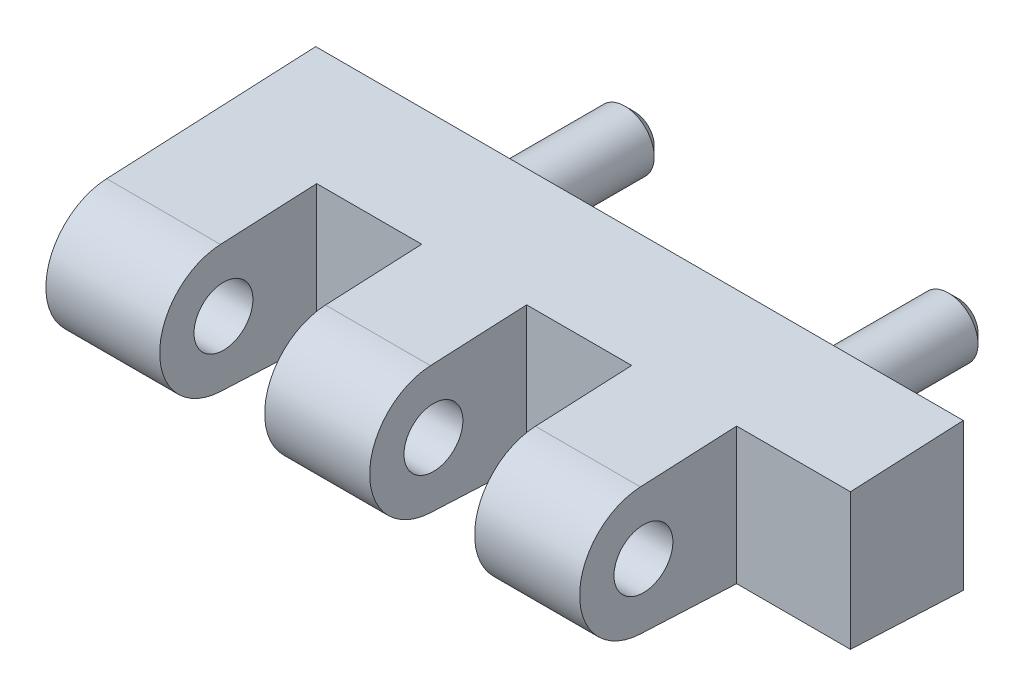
ISO-10303-21;
HEADER;
FILE_DESCRIPTION(('STEP AP214'),'2;1');
FILE_NAME('part.step','',(''),(''),'','','');
FILE_SCHEMA(('AUTOMOTIVE_DESIGN { 1 0 10303 214 1 1 1 1 }'));
ENDSEC;
DATA;
#1=APPLICATION_CONTEXT('core data for automotive mechanical design processes');
#2=APPLICATION_PROTOCOL_DEFINITION('international standard','automotive_design',2000,#1);
#3=PRODUCT_CONTEXT('',#1,'mechanical');
#4=PRODUCT('Part','Part','',(#3));
#5=PRODUCT_RELATED_PRODUCT_CATEGORY('part','',(#4));
#6=PRODUCT_DEFINITION_FORMATION('','',#4);
#7=PRODUCT_DEFINITION_CONTEXT('part definition',#1,'design');
#8=PRODUCT_DEFINITION('design','',#6,#7);
#9=PRODUCT_DEFINITION_SHAPE('','',#8);
#10=(LENGTH_UNIT() NAMED_UNIT(*) SI_UNIT(.MILLI.,.METRE.));
#11=(NAMED_UNIT(*) PLANE_ANGLE_UNIT() SI_UNIT($,.RADIAN.));
#12=(NAMED_UNIT(*) SI_UNIT($,.STERADIAN.) SOLID_ANGLE_UNIT());
#13=UNCERTAINTY_MEASURE_WITH_UNIT(LENGTH_MEASURE(1.E-05),#10,'distance_accuracy_value','');
#14=(GEOMETRIC_REPRESENTATION_CONTEXT(3) GLOBAL_UNCERTAINTY_ASSIGNED_CONTEXT((#13)) GLOBAL_UNIT_ASSIGNED_CONTEXT((#10,
#11,#12)) REPRESENTATION_CONTEXT('',''));
#15=CARTESIAN_POINT('',(0.,0.,0.));
#16=DIRECTION('',(0.,0.,1.));
#17=DIRECTION('',(1.,0.,0.));
#18=AXIS2_PLACEMENT_3D('',#15,#16,#17);
#19=CARTESIAN_POINT('',(49.5,0.,21.));
#20=DIRECTION('',(-1.,0.,0.));
#21=DIRECTION('',(0.,0.,1.));
#22=AXIS2_PLACEMENT_3D('',#19,#20,#21);
#23=CYLINDRICAL_SURFACE('',#22,6.5);
#24=DIRECTION('',(-1.,0.,0.));
#25=VECTOR('',#24,1.);
#26=CARTESIAN_POINT('',(49.5,-6.49274913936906,21.3069342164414));
#27=LINE('',#26,#25);
#28=CARTESIAN_POINT('',(-4.9,-6.49274913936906,21.3069342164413));
#29=VERTEX_POINT('',#28);
#30=CARTESIAN_POINT('',(-16.5,-6.49274913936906,21.3069342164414));
#31=VERTEX_POINT('',#30);
#32=EDGE_CURVE('E224',#29,#31,#27,.T.);
#33=ORIENTED_EDGE('',*,*,#32,.F.);
#34=CARTESIAN_POINT('',(-4.9,0.,21.));
#35=DIRECTION('',(-1.,0.,0.));
#36=DIRECTION('',(0.,0.,1.));
#37=AXIS2_PLACEMENT_3D('',#34,#35,#36);
#38=CIRCLE('',#37,6.5);
#39=CARTESIAN_POINT('',(-4.9,6.49274913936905,21.3069342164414));
#40=VERTEX_POINT('',#39);
#41=EDGE_CURVE('E181',#29,#40,#38,.T.);
#42=ORIENTED_EDGE('',*,*,#41,.T.);
#43=DIRECTION('',(-1.,0.,0.));
#44=VECTOR('',#43,1.);
#45=CARTESIAN_POINT('',(49.5,6.49274913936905,21.3069342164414));
#46=LINE('',#45,#44);
#47=CARTESIAN_POINT('',(-16.5,6.49274913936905,21.3069342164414));
#48=VERTEX_POINT('',#47);
#49=EDGE_CURVE('E228',#40,#48,#46,.T.);
#50=ORIENTED_EDGE('',*,*,#49,.T.);
#51=CARTESIAN_POINT('',(-16.5,0.,21.));
#52=DIRECTION('',(1.,0.,0.));
#53=DIRECTION('',(0.,0.,-1.));
#54=AXIS2_PLACEMENT_3D('',#51,#52,#53);
#55=CIRCLE('',#54,6.5);
#56=EDGE_CURVE('E213',#48,#31,#55,.T.);
#57=ORIENTED_EDGE('',*,*,#56,.T.);
#58=EDGE_LOOP('',(#33,#42,#50,#57));
#59=FACE_BOUND('',#58,.T.);
#60=ADVANCED_FACE('F14',(#59),#23,.T.);
#61=CARTESIAN_POINT('',(16.5,6.49274913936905,21.3069342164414));
#62=VERTEX_POINT('',#61);
#63=CARTESIAN_POINT('',(5.8,6.49274913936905,21.3069342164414));
#64=VERTEX_POINT('',#63);
#65=EDGE_CURVE('E230',#62,#64,#46,.T.);
#66=ORIENTED_EDGE('',*,*,#65,.T.);
#67=CARTESIAN_POINT('',(5.8,0.,21.));
#68=DIRECTION('',(1.,0.,0.));
#69=DIRECTION('',(0.,0.,-1.));
#70=AXIS2_PLACEMENT_3D('',#67,#68,#69);
#71=CIRCLE('',#70,6.5);
#72=CARTESIAN_POINT('',(5.8,-6.49274913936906,21.3069342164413));
#73=VERTEX_POINT('',#72);
#74=EDGE_CURVE('E171',#64,#73,#71,.T.);
#75=ORIENTED_EDGE('',*,*,#74,.T.);
#76=CARTESIAN_POINT('',(16.5,-6.49274913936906,21.3069342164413));
#77=VERTEX_POINT('',#76);
#78=EDGE_CURVE('E226',#77,#73,#27,.T.);
#79=ORIENTED_EDGE('',*,*,#78,.F.);
#80=CARTESIAN_POINT('',(16.5,0.,21.));
#81=DIRECTION('',(-1.,0.,0.));
#82=DIRECTION('',(0.,0.,1.));
#83=AXIS2_PLACEMENT_3D('',#80,#81,#82);
#84=CIRCLE('',#83,6.5);
#85=EDGE_CURVE('E161',#77,#62,#84,.T.);
#86=ORIENTED_EDGE('',*,*,#85,.T.);
#87=EDGE_LOOP('',(#66,#75,#79,#86));
#88=FACE_BOUND('',#87,.T.);
#89=ADVANCED_FACE('F271',(#88),#23,.T.);
#90=CARTESIAN_POINT('',(49.5,0.,21.));
#91=DIRECTION('',(-1.,0.,0.));
#92=DIRECTION('',(0.,0.,1.));
#93=AXIS2_PLACEMENT_3D('',#90,#91,#92);
#94=CYLINDRICAL_SURFACE('',#93,3.);
#95=CARTESIAN_POINT('',(-4.9,0.,21.));
#96=DIRECTION('',(-1.,0.,0.));
#97=DIRECTION('',(0.,0.,1.));
#98=AXIS2_PLACEMENT_3D('',#95,#96,#97);
#99=CIRCLE('',#98,3.);
#100=CARTESIAN_POINT('',(-4.9,0.,24.));
#101=VERTEX_POINT('',#100);
#102=EDGE_CURVE('E177',#101,#101,#99,.T.);
#103=ORIENTED_EDGE('',*,*,#102,.F.);
#104=EDGE_LOOP('',(#103));
#105=FACE_BOUND('',#104,.T.);
#106=CARTESIAN_POINT('',(-16.5,0.,21.));
#107=DIRECTION('',(1.,0.,0.));
#108=DIRECTION('',(0.,0.,-1.));
#109=AXIS2_PLACEMENT_3D('',#106,#107,#108);
#110=CIRCLE('',#109,3.);
#111=CARTESIAN_POINT('',(-16.5,0.,18.));
#112=VERTEX_POINT('',#111);
#113=EDGE_CURVE('E197',#112,#112,#110,.T.);
#114=ORIENTED_EDGE('',*,*,#113,.F.);
#115=EDGE_LOOP('',(#114));
#116=FACE_BOUND('',#115,.T.);
#117=ADVANCED_FACE('F279',(#105,#116),#94,.F.);
#118=CARTESIAN_POINT('',(49.5,0.,21.));
#119=DIRECTION('',(1.,0.,0.));
#120=DIRECTION('',(0.,0.,-1.));
#121=AXIS2_PLACEMENT_3D('',#118,#119,#120);
#122=PLANE('',#121);
#123=DIRECTION('',(0.,1.,0.));
#124=VECTOR('',#123,1.);
#125=CARTESIAN_POINT('',(49.5,0.,11.5));
#126=LINE('',#125,#124);
#127=CARTESIAN_POINT('',(49.5,-6.95635609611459,11.5));
#128=VERTEX_POINT('',#127);
#129=CARTESIAN_POINT('',(49.5,6.95635609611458,11.5));
#130=VERTEX_POINT('',#129);
#131=EDGE_CURVE('E120',#128,#130,#126,.T.);
#132=ORIENTED_EDGE('',*,*,#131,.F.);
#133=DIRECTION('',(0.,-0.0472206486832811,-0.998884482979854));
#134=VECTOR('',#133,1.);
#135=CARTESIAN_POINT('',(49.5,-7.5,0.));
#136=LINE('',#135,#134);
#137=CARTESIAN_POINT('',(49.5,-7.5,0.));
#138=VERTEX_POINT('',#137);
#139=EDGE_CURVE('E205',#128,#138,#136,.T.);
#140=ORIENTED_EDGE('',*,*,#139,.T.);
#141=DIRECTION('',(0.,1.,0.));
#142=VECTOR('',#141,1.);
#143=CARTESIAN_POINT('',(49.5,7.5,0.));
#144=LINE('',#143,#142);
#145=CARTESIAN_POINT('',(49.5,7.5,0.));
#146=VERTEX_POINT('',#145);
#147=EDGE_CURVE('E208',#138,#146,#144,.T.);
#148=ORIENTED_EDGE('',*,*,#147,.T.);
#149=DIRECTION('',(0.,-0.0472206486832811,0.998884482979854));
#150=VECTOR('',#149,1.);
#151=CARTESIAN_POINT('',(49.5,7.5,0.));
#152=LINE('',#151,#150);
#153=EDGE_CURVE('E203',#146,#130,#152,.T.);
#154=ORIENTED_EDGE('',*,*,#153,.T.);
#155=EDGE_LOOP('',(#132,#140,#148,#154));
#156=FACE_BOUND('',#155,.T.);
#157=ADVANCED_FACE('F345',(#156),#122,.T.);
#158=CARTESIAN_POINT('',(-16.5,0.,21.));
#159=DIRECTION('',(1.,0.,0.));
#160=DIRECTION('',(0.,0.,-1.));
#161=AXIS2_PLACEMENT_3D('',#158,#159,#160);
#162=PLANE('',#161);
#163=DIRECTION('',(0.,-0.0472206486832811,0.998884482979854));
#164=VECTOR('',#163,1.);
#165=CARTESIAN_POINT('',(-16.5,7.5,0.));
#166=LINE('',#165,#164);
#167=CARTESIAN_POINT('',(-16.5,7.5,0.));
#168=VERTEX_POINT('',#167);
#169=EDGE_CURVE('E202',#168,#48,#166,.T.);
#170=ORIENTED_EDGE('',*,*,#169,.F.);
#171=DIRECTION('',(0.,1.,0.));
#172=VECTOR('',#171,1.);
#173=CARTESIAN_POINT('',(-16.5,7.5,0.));
#174=LINE('',#173,#172);
#175=CARTESIAN_POINT('',(-16.5,-7.5,0.));
#176=VERTEX_POINT('',#175);
#177=EDGE_CURVE('E206',#176,#168,#174,.T.);
#178=ORIENTED_EDGE('',*,*,#177,.F.);
#179=DIRECTION('',(0.,-0.0472206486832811,-0.998884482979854));
#180=VECTOR('',#179,1.);
#181=CARTESIAN_POINT('',(-16.5,-7.5,0.));
#182=LINE('',#181,#180);
#183=EDGE_CURVE('E216',#31,#176,#182,.T.);
#184=ORIENTED_EDGE('',*,*,#183,.F.);
#185=ORIENTED_EDGE('',*,*,#56,.F.);
#186=EDGE_LOOP('',(#170,#178,#184,#185));
#187=FACE_BOUND('',#186,.T.);
#188=ORIENTED_EDGE('',*,*,#113,.T.);
#189=EDGE_LOOP('',(#188));
#190=FACE_BOUND('',#189,.T.);
#191=ADVANCED_FACE('F294',(#187,#190),#162,.F.);
#192=CARTESIAN_POINT('',(49.5,7.5,0.));
#193=DIRECTION('',(0.,-0.998884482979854,-0.0472206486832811));
#194=DIRECTION('',(0.,0.0472206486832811,-0.998884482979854));
#195=AXIS2_PLACEMENT_3D('',#192,#193,#194);
#196=PLANE('',#195);
#197=ORIENTED_EDGE('',*,*,#49,.F.);
#198=DIRECTION('',(0.,0.0472206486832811,-0.998884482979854));
#199=VECTOR('',#198,1.);
#200=CARTESIAN_POINT('',(-4.9,7.5,0.));
#201=LINE('',#200,#199);
#202=CARTESIAN_POINT('',(-4.9,6.95635609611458,11.5));
#203=VERTEX_POINT('',#202);
#204=EDGE_CURVE('E184',#40,#203,#201,.T.);
#205=ORIENTED_EDGE('',*,*,#204,.T.);
#206=DIRECTION('',(1.,0.,0.));
#207=VECTOR('',#206,1.);
#208=CARTESIAN_POINT('',(49.5,6.95635609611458,11.5));
#209=LINE('',#208,#207);
#210=CARTESIAN_POINT('',(5.8,6.95635609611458,11.5));
#211=VERTEX_POINT('',#210);
#212=EDGE_CURVE('E190',#203,#211,#209,.T.);
#213=ORIENTED_EDGE('',*,*,#212,.T.);
#214=DIRECTION('',(0.,-0.0472206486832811,0.998884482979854));
#215=VECTOR('',#214,1.);
#216=CARTESIAN_POINT('',(5.8,7.5,0.));
#217=LINE('',#216,#215);
#218=EDGE_CURVE('E174',#211,#64,#217,.T.);
#219=ORIENTED_EDGE('',*,*,#218,.T.);
#220=ORIENTED_EDGE('',*,*,#65,.F.);
#221=DIRECTION('',(0.,0.0472206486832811,-0.998884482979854));
#222=VECTOR('',#221,1.);
#223=CARTESIAN_POINT('',(16.5,7.5,0.));
#224=LINE('',#223,#222);
#225=CARTESIAN_POINT('',(16.5,6.95635609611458,11.5));
#226=VERTEX_POINT('',#225);
#227=EDGE_CURVE('E164',#62,#226,#224,.T.);
#228=ORIENTED_EDGE('',*,*,#227,.T.);
#229=DIRECTION('',(1.,0.,0.));
#230=VECTOR('',#229,1.);
#231=CARTESIAN_POINT('',(49.5,6.95635609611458,11.5));
#232=LINE('',#231,#230);
#233=CARTESIAN_POINT('',(27.2,6.95635609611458,11.5));
#234=VERTEX_POINT('',#233);
#235=EDGE_CURVE('E125',#226,#234,#232,.T.);
#236=ORIENTED_EDGE('',*,*,#235,.T.);
#237=DIRECTION('',(0.,-0.0472206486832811,0.998884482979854));
#238=VECTOR('',#237,1.);
#239=CARTESIAN_POINT('',(27.2,7.5,0.));
#240=LINE('',#239,#238);
#241=CARTESIAN_POINT('',(27.2,6.49274913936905,21.3069342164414));
#242=VERTEX_POINT('',#241);
#243=EDGE_CURVE('E155',#234,#242,#240,.T.);
#244=ORIENTED_EDGE('',*,*,#243,.T.);
#245=CARTESIAN_POINT('',(37.9,6.49274913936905,21.3069342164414));
#246=VERTEX_POINT('',#245);
#247=EDGE_CURVE('E140',#246,#242,#46,.T.);
#248=ORIENTED_EDGE('',*,*,#247,.F.);
#249=DIRECTION('',(0.,0.0472206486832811,-0.998884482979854));
#250=VECTOR('',#249,1.);
#251=CARTESIAN_POINT('',(37.9,7.5,0.));
#252=LINE('',#251,#250);
#253=CARTESIAN_POINT('',(37.9,6.95635609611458,11.5));
#254=VERTEX_POINT('',#253);
#255=EDGE_CURVE('E129',#246,#254,#252,.T.);
#256=ORIENTED_EDGE('',*,*,#255,.T.);
#257=DIRECTION('',(1.,0.,0.));
#258=VECTOR('',#257,1.);
#259=CARTESIAN_POINT('',(49.5,6.95635609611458,11.5));
#260=LINE('',#259,#258);
#261=EDGE_CURVE('E114',#254,#130,#260,.T.);
#262=ORIENTED_EDGE('',*,*,#261,.T.);
#263=ORIENTED_EDGE('',*,*,#153,.F.);
#264=DIRECTION('',(-1.,0.,0.));
#265=VECTOR('',#264,1.);
#266=CARTESIAN_POINT('',(49.5,7.5,0.));
#267=LINE('',#266,#265);
#268=EDGE_CURVE('E210',#146,#168,#267,.T.);
#269=ORIENTED_EDGE('',*,*,#268,.T.);
#270=ORIENTED_EDGE('',*,*,#169,.T.);
#271=EDGE_LOOP('',(#197,#205,#213,#219,#220,#228,#236,#244,#248,#256,#262,#263,#269,#270));
#272=FACE_BOUND('',#271,.T.);
#273=ADVANCED_FACE('F137',(#272),#196,.F.);
#274=ORIENTED_EDGE('',*,*,#247,.T.);
#275=CARTESIAN_POINT('',(27.2,0.,21.));
#276=DIRECTION('',(1.,0.,0.));
#277=DIRECTION('',(0.,0.,-1.));
#278=AXIS2_PLACEMENT_3D('',#275,#276,#277);
#279=CIRCLE('',#278,6.5);
#280=CARTESIAN_POINT('',(27.2,-6.49274913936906,21.3069342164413));
#281=VERTEX_POINT('',#280);
#282=EDGE_CURVE('E152',#242,#281,#279,.T.);
#283=ORIENTED_EDGE('',*,*,#282,.T.);
#284=CARTESIAN_POINT('',(37.9,-6.49274913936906,21.3069342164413));
#285=VERTEX_POINT('',#284);
#286=EDGE_CURVE('E227',#285,#281,#27,.T.);
#287=ORIENTED_EDGE('',*,*,#286,.F.);
#288=CARTESIAN_POINT('',(37.9,0.,21.));
#289=DIRECTION('',(-1.,0.,0.));
#290=DIRECTION('',(0.,0.,1.));
#291=AXIS2_PLACEMENT_3D('',#288,#289,#290);
#292=CIRCLE('',#291,6.5);
#293=EDGE_CURVE('E142',#285,#246,#292,.T.);
#294=ORIENTED_EDGE('',*,*,#293,.T.);
#295=EDGE_LOOP('',(#274,#283,#287,#294));
#296=FACE_BOUND('',#295,.T.);
#297=ADVANCED_FACE('F274',(#296),#23,.T.);
#298=CARTESIAN_POINT('',(49.5,-7.5,0.));
#299=DIRECTION('',(0.,0.998884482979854,-0.0472206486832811));
#300=DIRECTION('',(0.,0.0472206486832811,0.998884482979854));
#301=AXIS2_PLACEMENT_3D('',#298,#299,#300);
#302=PLANE('',#301);
#303=DIRECTION('',(-1.,0.,0.));
#304=VECTOR('',#303,1.);
#305=CARTESIAN_POINT('',(49.5,-6.95635609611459,11.5));
#306=LINE('',#305,#304);
#307=CARTESIAN_POINT('',(5.8,-6.95635609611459,11.5));
#308=VERTEX_POINT('',#307);
#309=CARTESIAN_POINT('',(-4.9,-6.95635609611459,11.5));
#310=VERTEX_POINT('',#309);
#311=EDGE_CURVE('E246',#308,#310,#306,.T.);
#312=ORIENTED_EDGE('',*,*,#311,.T.);
#313=DIRECTION('',(0.,0.0472206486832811,0.998884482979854));
#314=VECTOR('',#313,1.);
#315=CARTESIAN_POINT('',(-4.9,-7.5,0.));
#316=LINE('',#315,#314);
#317=EDGE_CURVE('E178',#310,#29,#316,.T.);
#318=ORIENTED_EDGE('',*,*,#317,.T.);
#319=ORIENTED_EDGE('',*,*,#32,.T.);
#320=ORIENTED_EDGE('',*,*,#183,.T.);
#321=DIRECTION('',(-1.,0.,0.));
#322=VECTOR('',#321,1.);
#323=CARTESIAN_POINT('',(49.5,-7.5,0.));
#324=LINE('',#323,#322);
#325=EDGE_CURVE('E221',#138,#176,#324,.T.);
#326=ORIENTED_EDGE('',*,*,#325,.F.);
#327=ORIENTED_EDGE('',*,*,#139,.F.);
#328=DIRECTION('',(-1.,0.,0.));
#329=VECTOR('',#328,1.);
#330=CARTESIAN_POINT('',(49.5,-6.95635609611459,11.5));
#331=LINE('',#330,#329);
#332=CARTESIAN_POINT('',(37.9,-6.95635609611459,11.5));
#333=VERTEX_POINT('',#332);
#334=EDGE_CURVE('E241',#128,#333,#331,.T.);
#335=ORIENTED_EDGE('',*,*,#334,.T.);
#336=DIRECTION('',(0.,0.0472206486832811,0.998884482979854));
#337=VECTOR('',#336,1.);
#338=CARTESIAN_POINT('',(37.9,-7.5,0.));
#339=LINE('',#338,#337);
#340=EDGE_CURVE('E132',#333,#285,#339,.T.);
#341=ORIENTED_EDGE('',*,*,#340,.T.);
#342=ORIENTED_EDGE('',*,*,#286,.T.);
#343=DIRECTION('',(0.,-0.0472206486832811,-0.998884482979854));
#344=VECTOR('',#343,1.);
#345=CARTESIAN_POINT('',(27.2,-7.5,0.));
#346=LINE('',#345,#344);
#347=CARTESIAN_POINT('',(27.2,-6.95635609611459,11.5));
#348=VERTEX_POINT('',#347);
#349=EDGE_CURVE('E145',#281,#348,#346,.T.);
#350=ORIENTED_EDGE('',*,*,#349,.T.);
#351=DIRECTION('',(-1.,0.,0.));
#352=VECTOR('',#351,1.);
#353=CARTESIAN_POINT('',(49.5,-6.95635609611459,11.5));
#354=LINE('',#353,#352);
#355=CARTESIAN_POINT('',(16.5,-6.95635609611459,11.5));
#356=VERTEX_POINT('',#355);
#357=EDGE_CURVE('E243',#348,#356,#354,.T.);
#358=ORIENTED_EDGE('',*,*,#357,.T.);
#359=DIRECTION('',(0.,0.0472206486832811,0.998884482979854));
#360=VECTOR('',#359,1.);
#361=CARTESIAN_POINT('',(16.5,-7.5,0.));
#362=LINE('',#361,#360);
#363=EDGE_CURVE('E158',#356,#77,#362,.T.);
#364=ORIENTED_EDGE('',*,*,#363,.T.);
#365=ORIENTED_EDGE('',*,*,#78,.T.);
#366=DIRECTION('',(0.,-0.0472206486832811,-0.998884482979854));
#367=VECTOR('',#366,1.);
#368=CARTESIAN_POINT('',(5.8,-7.5,0.));
#369=LINE('',#368,#367);
#370=EDGE_CURVE('E168',#73,#308,#369,.T.);
#371=ORIENTED_EDGE('',*,*,#370,.T.);
#372=EDGE_LOOP('',(#312,#318,#319,#320,#326,#327,#335,#341,#342,#350,#358,#364,#365,#371));
#373=FACE_BOUND('',#372,.T.);
#374=ADVANCED_FACE('F285',(#373),#302,.F.);
#375=CARTESIAN_POINT('',(49.5,7.5,0.));
#376=DIRECTION('',(0.,0.,1.));
#377=DIRECTION('',(0.,-1.,0.));
#378=AXIS2_PLACEMENT_3D('',#375,#376,#377);
#379=PLANE('',#378);
#380=CARTESIAN_POINT('',(0.,0.,0.));
#381=DIRECTION('',(0.,0.,-1.));
#382=DIRECTION('',(0.,1.,0.));
#383=AXIS2_PLACEMENT_3D('',#380,#381,#382);
#384=CIRCLE('',#383,3.);
#385=CARTESIAN_POINT('',(0.,3.,0.));
#386=VERTEX_POINT('',#385);
#387=EDGE_CURVE('E194',#386,#386,#384,.T.);
#388=ORIENTED_EDGE('',*,*,#387,.F.);
#389=EDGE_LOOP('',(#388));
#390=FACE_BOUND('',#389,.T.);
#391=CARTESIAN_POINT('',(33.,0.,0.));
#392=DIRECTION('',(0.,0.,-1.));
#393=DIRECTION('',(0.,1.,0.));
#394=AXIS2_PLACEMENT_3D('',#391,#392,#393);
#395=CIRCLE('',#394,3.);
#396=CARTESIAN_POINT('',(33.,3.,0.));
#397=VERTEX_POINT('',#396);
#398=EDGE_CURVE('E193',#397,#397,#395,.T.);
#399=ORIENTED_EDGE('',*,*,#398,.F.);
#400=EDGE_LOOP('',(#399));
#401=FACE_BOUND('',#400,.T.);
#402=ORIENTED_EDGE('',*,*,#177,.T.);
#403=ORIENTED_EDGE('',*,*,#268,.F.);
#404=ORIENTED_EDGE('',*,*,#147,.F.);
#405=ORIENTED_EDGE('',*,*,#325,.T.);
#406=EDGE_LOOP('',(#402,#403,#404,#405));
#407=FACE_BOUND('',#406,.T.);
#408=ADVANCED_FACE('F292',(#390,#401,#407),#379,.F.);
#409=CARTESIAN_POINT('',(37.9,-9.5,32.8867042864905));
#410=DIRECTION('',(-1.,0.,0.));
#411=DIRECTION('',(0.,0.,1.));
#412=AXIS2_PLACEMENT_3D('',#409,#410,#411);
#413=PLANE('',#412);
#414=CARTESIAN_POINT('',(37.9,0.,21.));
#415=DIRECTION('',(-1.,0.,0.));
#416=DIRECTION('',(0.,0.,1.));
#417=AXIS2_PLACEMENT_3D('',#414,#415,#416);
#418=CIRCLE('',#417,3.);
#419=CARTESIAN_POINT('',(37.9,0.,24.));
#420=VERTEX_POINT('',#419);
#421=EDGE_CURVE('E231',#420,#420,#418,.T.);
#422=ORIENTED_EDGE('',*,*,#421,.T.);
#423=EDGE_LOOP('',(#422));
#424=FACE_BOUND('',#423,.T.);
#425=ORIENTED_EDGE('',*,*,#293,.F.);
#426=ORIENTED_EDGE('',*,*,#340,.F.);
#427=DIRECTION('',(0.,1.,0.));
#428=VECTOR('',#427,1.);
#429=CARTESIAN_POINT('',(37.9,-9.5,11.5));
#430=LINE('',#429,#428);
#431=EDGE_CURVE('E117',#333,#254,#430,.T.);
#432=ORIENTED_EDGE('',*,*,#431,.T.);
#433=ORIENTED_EDGE('',*,*,#255,.F.);
#434=EDGE_LOOP('',(#425,#426,#432,#433));
#435=FACE_BOUND('',#434,.T.);
#436=ADVANCED_FACE('F128',(#424,#435),#413,.F.);
#437=CARTESIAN_POINT('',(37.9,-9.5,11.5));
#438=DIRECTION('',(0.,0.,-1.));
#439=DIRECTION('',(-1.,0.,0.));
#440=AXIS2_PLACEMENT_3D('',#437,#438,#439);
#441=PLANE('',#440);
#442=ORIENTED_EDGE('',*,*,#431,.F.);
#443=ORIENTED_EDGE('',*,*,#334,.F.);
#444=ORIENTED_EDGE('',*,*,#131,.T.);
#445=ORIENTED_EDGE('',*,*,#261,.F.);
#446=EDGE_LOOP('',(#442,#443,#444,#445));
#447=FACE_BOUND('',#446,.T.);
#448=ADVANCED_FACE('F116',(#447),#441,.F.);
#449=CARTESIAN_POINT('',(27.2,-9.5,32.8867042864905));
#450=DIRECTION('',(1.,0.,0.));
#451=DIRECTION('',(0.,0.,-1.));
#452=AXIS2_PLACEMENT_3D('',#449,#450,#451);
#453=PLANE('',#452);
#454=CARTESIAN_POINT('',(27.2,0.,21.));
#455=DIRECTION('',(1.,0.,0.));
#456=DIRECTION('',(0.,0.,-1.));
#457=AXIS2_PLACEMENT_3D('',#454,#455,#456);
#458=CIRCLE('',#457,3.);
#459=CARTESIAN_POINT('',(27.2,0.,18.));
#460=VERTEX_POINT('',#459);
#461=EDGE_CURVE('E141',#460,#460,#458,.T.);
#462=ORIENTED_EDGE('',*,*,#461,.T.);
#463=EDGE_LOOP('',(#462));
#464=FACE_BOUND('',#463,.T.);
#465=DIRECTION('',(0.,1.,0.));
#466=VECTOR('',#465,1.);
#467=CARTESIAN_POINT('',(27.2,-9.5,11.5));
#468=LINE('',#467,#466);
#469=EDGE_CURVE('E37',#348,#234,#468,.T.);
#470=ORIENTED_EDGE('',*,*,#469,.F.);
#471=ORIENTED_EDGE('',*,*,#349,.F.);
#472=ORIENTED_EDGE('',*,*,#282,.F.);
#473=ORIENTED_EDGE('',*,*,#243,.F.);
#474=EDGE_LOOP('',(#470,#471,#472,#473));
#475=FACE_BOUND('',#474,.T.);
#476=ADVANCED_FACE('F318',(#464,#475),#453,.F.);
#477=CARTESIAN_POINT('',(16.5,-9.5,32.8867042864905));
#478=DIRECTION('',(-1.,0.,0.));
#479=DIRECTION('',(0.,0.,1.));
#480=AXIS2_PLACEMENT_3D('',#477,#478,#479);
#481=PLANE('',#480);
#482=CARTESIAN_POINT('',(16.5,0.,21.));
#483=DIRECTION('',(-1.,0.,0.));
#484=DIRECTION('',(0.,0.,1.));
#485=AXIS2_PLACEMENT_3D('',#482,#483,#484);
#486=CIRCLE('',#485,3.);
#487=CARTESIAN_POINT('',(16.5,0.,24.));
#488=VERTEX_POINT('',#487);
#489=EDGE_CURVE('E157',#488,#488,#486,.T.);
#490=ORIENTED_EDGE('',*,*,#489,.T.);
#491=EDGE_LOOP('',(#490));
#492=FACE_BOUND('',#491,.T.);
#493=ORIENTED_EDGE('',*,*,#85,.F.);
#494=ORIENTED_EDGE('',*,*,#363,.F.);
#495=DIRECTION('',(0.,1.,0.));
#496=VECTOR('',#495,1.);
#497=CARTESIAN_POINT('',(16.5,-9.5,11.5));
#498=LINE('',#497,#496);
#499=EDGE_CURVE('E306',#356,#226,#498,.T.);
#500=ORIENTED_EDGE('',*,*,#499,.T.);
#501=ORIENTED_EDGE('',*,*,#227,.F.);
#502=EDGE_LOOP('',(#493,#494,#500,#501));
#503=FACE_BOUND('',#502,.T.);
#504=ADVANCED_FACE('F315',(#492,#503),#481,.F.);
#505=CARTESIAN_POINT('',(16.5,-9.5,11.5));
#506=DIRECTION('',(0.,0.,-1.));
#507=DIRECTION('',(-1.,0.,0.));
#508=AXIS2_PLACEMENT_3D('',#505,#506,#507);
#509=PLANE('',#508);
#510=ORIENTED_EDGE('',*,*,#499,.F.);
#511=ORIENTED_EDGE('',*,*,#357,.F.);
#512=ORIENTED_EDGE('',*,*,#469,.T.);
#513=ORIENTED_EDGE('',*,*,#235,.F.);
#514=EDGE_LOOP('',(#510,#511,#512,#513));
#515=FACE_BOUND('',#514,.T.);
#516=ADVANCED_FACE('F317',(#515),#509,.F.);
#517=CARTESIAN_POINT('',(5.8,0.,21.));
#518=DIRECTION('',(1.,0.,0.));
#519=DIRECTION('',(0.,0.,-1.));
#520=AXIS2_PLACEMENT_3D('',#517,#518,#519);
#521=CIRCLE('',#520,3.);
#522=CARTESIAN_POINT('',(5.8,0.,18.));
#523=VERTEX_POINT('',#522);
#524=EDGE_CURVE('E167',#523,#523,#521,.T.);
#525=ORIENTED_EDGE('',*,*,#524,.F.);
#526=EDGE_LOOP('',(#525));
#527=FACE_BOUND('',#526,.T.);
#528=ORIENTED_EDGE('',*,*,#489,.F.);
#529=EDGE_LOOP('',(#528));
#530=FACE_BOUND('',#529,.T.);
#531=ADVANCED_FACE('F344',(#527,#530),#94,.F.);
#532=CARTESIAN_POINT('',(-4.9,-9.5,11.5));
#533=DIRECTION('',(0.,0.,-1.));
#534=DIRECTION('',(-1.,0.,0.));
#535=AXIS2_PLACEMENT_3D('',#532,#533,#534);
#536=PLANE('',#535);
#537=DIRECTION('',(0.,1.,0.));
#538=VECTOR('',#537,1.);
#539=CARTESIAN_POINT('',(-4.9,-9.5,11.5));
#540=LINE('',#539,#538);
#541=EDGE_CURVE('E233',#310,#203,#540,.T.);
#542=ORIENTED_EDGE('',*,*,#541,.F.);
#543=ORIENTED_EDGE('',*,*,#311,.F.);
#544=DIRECTION('',(0.,1.,0.));
#545=VECTOR('',#544,1.);
#546=CARTESIAN_POINT('',(5.8,-9.5,11.5));
#547=LINE('',#546,#545);
#548=EDGE_CURVE('E29',#308,#211,#547,.T.);
#549=ORIENTED_EDGE('',*,*,#548,.T.);
#550=ORIENTED_EDGE('',*,*,#212,.F.);
#551=EDGE_LOOP('',(#542,#543,#549,#550));
#552=FACE_BOUND('',#551,.T.);
#553=ADVANCED_FACE('F304',(#552),#536,.F.);
#554=CARTESIAN_POINT('',(-4.9,-9.5,38.2333803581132));
#555=DIRECTION('',(-1.,0.,0.));
#556=DIRECTION('',(0.,0.,1.));
#557=AXIS2_PLACEMENT_3D('',#554,#555,#556);
#558=PLANE('',#557);
#559=ORIENTED_EDGE('',*,*,#102,.T.);
#560=EDGE_LOOP('',(#559));
#561=FACE_BOUND('',#560,.T.);
#562=ORIENTED_EDGE('',*,*,#41,.F.);
#563=ORIENTED_EDGE('',*,*,#317,.F.);
#564=ORIENTED_EDGE('',*,*,#541,.T.);
#565=ORIENTED_EDGE('',*,*,#204,.F.);
#566=EDGE_LOOP('',(#562,#563,#564,#565));
#567=FACE_BOUND('',#566,.T.);
#568=ADVANCED_FACE('F335',(#561,#567),#558,.F.);
#569=CARTESIAN_POINT('',(5.8,-9.5,11.5));
#570=DIRECTION('',(1.,0.,0.));
#571=DIRECTION('',(0.,0.,-1.));
#572=AXIS2_PLACEMENT_3D('',#569,#570,#571);
#573=PLANE('',#572);
#574=ORIENTED_EDGE('',*,*,#524,.T.);
#575=EDGE_LOOP('',(#574));
#576=FACE_BOUND('',#575,.T.);
#577=ORIENTED_EDGE('',*,*,#548,.F.);
#578=ORIENTED_EDGE('',*,*,#370,.F.);
#579=ORIENTED_EDGE('',*,*,#74,.F.);
#580=ORIENTED_EDGE('',*,*,#218,.F.);
#581=EDGE_LOOP('',(#577,#578,#579,#580));
#582=FACE_BOUND('',#581,.T.);
#583=ADVANCED_FACE('F301',(#576,#582),#573,.F.);
#584=ORIENTED_EDGE('',*,*,#461,.F.);
#585=EDGE_LOOP('',(#584));
#586=FACE_BOUND('',#585,.T.);
#587=ORIENTED_EDGE('',*,*,#421,.F.);
#588=EDGE_LOOP('',(#587));
#589=FACE_BOUND('',#588,.T.);
#590=ADVANCED_FACE('F339',(#586,#589),#94,.F.);
#591=CARTESIAN_POINT('',(33.,0.,-16.));
#592=DIRECTION('',(0.,0.,1.));
#593=DIRECTION('',(0.,-1.,0.));
#594=AXIS2_PLACEMENT_3D('',#591,#592,#593);
#595=CYLINDRICAL_SURFACE('',#594,3.);
#596=CARTESIAN_POINT('',(33.,0.,-15.));
#597=DIRECTION('',(0.,0.,-1.));
#598=DIRECTION('',(0.,1.,0.));
#599=AXIS2_PLACEMENT_3D('',#596,#597,#598);
#600=CIRCLE('',#599,3.);
#601=CARTESIAN_POINT('',(33.,3.,-15.));
#602=VERTEX_POINT('',#601);
#603=EDGE_CURVE('E9',#602,#602,#600,.F.);
#604=ORIENTED_EDGE('',*,*,#603,.T.);
#605=EDGE_LOOP('',(#604));
#606=FACE_BOUND('',#605,.T.);
#607=ORIENTED_EDGE('',*,*,#398,.T.);
#608=EDGE_LOOP('',(#607));
#609=FACE_BOUND('',#608,.T.);
#610=ADVANCED_FACE('F342',(#606,#609),#595,.T.);
#611=CARTESIAN_POINT('',(33.,0.,-16.));
#612=DIRECTION('',(0.,0.,-1.));
#613=DIRECTION('',(0.,1.,0.));
#614=AXIS2_PLACEMENT_3D('',#611,#612,#613);
#615=PLANE('',#614);
#616=CARTESIAN_POINT('',(33.,0.,-16.));
#617=DIRECTION('',(0.,0.,-1.));
#618=DIRECTION('',(0.,1.,0.));
#619=AXIS2_PLACEMENT_3D('',#616,#617,#618);
#620=CIRCLE('',#619,2.);
#621=CARTESIAN_POINT('',(33.,2.,-16.));
#622=VERTEX_POINT('',#621);
#623=EDGE_CURVE('E22',#622,#622,#620,.T.);
#624=ORIENTED_EDGE('',*,*,#623,.T.);
#625=EDGE_LOOP('',(#624));
#626=FACE_BOUND('',#625,.T.);
#627=ADVANCED_FACE('F257',(#626),#615,.T.);
#628=CARTESIAN_POINT('',(0.,0.,-16.));
#629=DIRECTION('',(0.,0.,1.));
#630=DIRECTION('',(0.,-1.,0.));
#631=AXIS2_PLACEMENT_3D('',#628,#629,#630);
#632=CYLINDRICAL_SURFACE('',#631,3.);
#633=CARTESIAN_POINT('',(0.,0.,-15.));
#634=DIRECTION('',(0.,0.,-1.));
#635=DIRECTION('',(0.,1.,0.));
#636=AXIS2_PLACEMENT_3D('',#633,#634,#635);
#637=CIRCLE('',#636,3.);
#638=CARTESIAN_POINT('',(0.,3.,-15.));
#639=VERTEX_POINT('',#638);
#640=EDGE_CURVE('E252',#639,#639,#637,.F.);
#641=ORIENTED_EDGE('',*,*,#640,.T.);
#642=EDGE_LOOP('',(#641));
#643=FACE_BOUND('',#642,.T.);
#644=ORIENTED_EDGE('',*,*,#387,.T.);
#645=EDGE_LOOP('',(#644));
#646=FACE_BOUND('',#645,.T.);
#647=ADVANCED_FACE('F401',(#643,#646),#632,.T.);
#648=CARTESIAN_POINT('',(0.,0.,-16.));
#649=DIRECTION('',(0.,0.,-1.));
#650=DIRECTION('',(0.,1.,0.));
#651=AXIS2_PLACEMENT_3D('',#648,#649,#650);
#652=PLANE('',#651);
#653=CARTESIAN_POINT('',(0.,0.,-16.));
#654=DIRECTION('',(0.,0.,-1.));
#655=DIRECTION('',(0.,1.,0.));
#656=AXIS2_PLACEMENT_3D('',#653,#654,#655);
#657=CIRCLE('',#656,2.);
#658=CARTESIAN_POINT('',(0.,2.,-16.));
#659=VERTEX_POINT('',#658);
#660=EDGE_CURVE('E249',#659,#659,#657,.T.);
#661=ORIENTED_EDGE('',*,*,#660,.T.);
#662=EDGE_LOOP('',(#661));
#663=FACE_BOUND('',#662,.T.);
#664=ADVANCED_FACE('F267',(#663),#652,.T.);
#665=CARTESIAN_POINT('',(0.,0.,-16.));
#666=DIRECTION('',(0.,0.,1.));
#667=DIRECTION('',(0.,-1.,0.));
#668=AXIS2_PLACEMENT_3D('',#665,#666,#667);
#669=CONICAL_SURFACE('',#668,2.,0.785398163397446);
#670=ORIENTED_EDGE('',*,*,#640,.F.);
#671=EDGE_LOOP('',(#670));
#672=FACE_BOUND('',#671,.T.);
#673=ORIENTED_EDGE('',*,*,#660,.F.);
#674=EDGE_LOOP('',(#673));
#675=FACE_BOUND('',#674,.T.);
#676=ADVANCED_FACE('F260',(#672,#675),#669,.T.);
#677=CARTESIAN_POINT('',(33.,0.,-16.));
#678=DIRECTION('',(0.,0.,1.));
#679=DIRECTION('',(0.,-1.,0.));
#680=AXIS2_PLACEMENT_3D('',#677,#678,#679);
#681=CONICAL_SURFACE('',#680,2.,0.785398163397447);
#682=ORIENTED_EDGE('',*,*,#603,.F.);
#683=EDGE_LOOP('',(#682));
#684=FACE_BOUND('',#683,.T.);
#685=ORIENTED_EDGE('',*,*,#623,.F.);
#686=EDGE_LOOP('',(#685));
#687=FACE_BOUND('',#686,.T.);
#688=ADVANCED_FACE('F16',(#684,#687),#681,.T.);
#689=CLOSED_SHELL('',(#60,#89,#117,#157,#191,#273,#297,#374,#408,#436,#448,#476,#504,#516,#531,
#553,#568,#583,#590,#610,#627,#647,#664,#676,#688));
#690=MANIFOLD_SOLID_BREP('B1',#689);
#691=ADVANCED_BREP_SHAPE_REPRESENTATION('',(#18,#690),#14);
#692=SHAPE_DEFINITION_REPRESENTATION(#9,#691);
ENDSEC;
END-ISO-10303-21;
